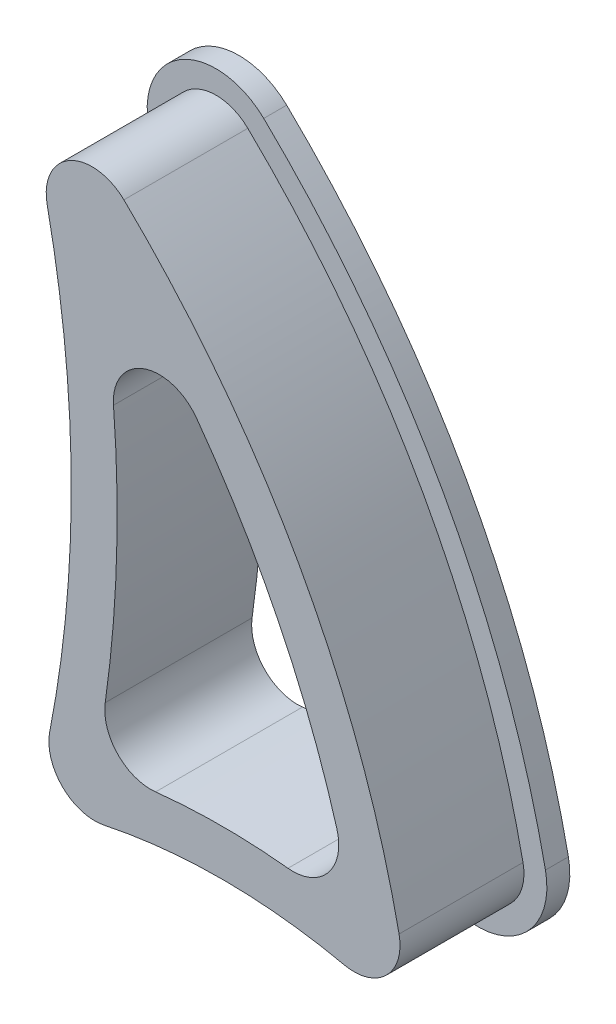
from build123d import *

# Parameters (mm, degrees)
EXTRUDE_1_DEPTH = 6.4
EXTRUDE_2_DEPTH = 1
FILLET_1_R      = 2
FILLET_2_R      = 3


with BuildPart() as part:
    # Sketch 1 → Extrude 1 (new body)
    with BuildSketch(Plane.XY):
        with BuildLine():
            ThreePointArc((-8.756657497, 29), (3.046339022, 16.342325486), (8.743342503, 0))
            ThreePointArc((8.743342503, 0), (0.493342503, 1.4004767), (-7.756657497, 0))
            ThreePointArc((-7.756657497, 0), (-6.1066553, 14.574138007), (-8.756657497, 29))
        make_face()
        with BuildLine():
            ThreePointArc((-5.052711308, 2.824732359), (0.601043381, 3.400261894), (6.250026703, 2.779646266))
            ThreePointArc((6.250026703, 2.779646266), (2.101144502, 13.980744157), (-5.170124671, 23.457371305))
            ThreePointArc((-5.170124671, 23.457371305), (-4.077797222, 13.146933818), (-5.052711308, 2.824732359))
        make_face(mode=Mode.SUBTRACT)
    extrude(amount=EXTRUDE_1_DEPTH)

    # Sketch 1_3 → Extrude 2 (add)
    with BuildSketch(Plane.XY):
        with BuildLine():
            ThreePointArc((-9.281176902, -1.680153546), (-7.125821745, 15.038837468), (-10.76407517, 31.498889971))
            ThreePointArc((-10.76407517, 31.498889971), (3.531164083, 17.463074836), (9.915438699, -1.526369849))
            ThreePointArc((9.915438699, -1.526369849), (0.30108516, 0.399706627), (-9.281176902, -1.680153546))
        make_face()
        with BuildLine():
            ThreePointArc((-7.756657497, 0), (-6.1066553, 14.574138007), (-8.756657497, 29))
            ThreePointArc((-8.756657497, 29), (3.046339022, 16.342325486), (8.743342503, 0))
            ThreePointArc((8.743342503, 0), (0.493342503, 1.4004767), (-7.756657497, 0))
        make_face(mode=Mode.SUBTRACT)
    extrude(amount=EXTRUDE_2_DEPTH)

    # Fillet 1
    fillet_1_edges = [part.edges().sort_by_distance(p)[0] for p in [
        (8.743342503, 0, 3.7),
        (-7.756657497, 0, 3.7),
        (-8.756657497, 29, 3.7),
        (6.250026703, 2.779646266, 3.2),
        (-5.170124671, 23.457371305, 3.2),
        (-5.052711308, 2.824732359, 3.2),
    ]]
    fillet(fillet_1_edges, radius=FILLET_1_R)

    # Fillet 2
    fillet_2_edges = [part.edges().sort_by_distance(p)[0] for p in [
        (-10.76407517, 31.498889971, 0.5),
        (-9.281176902, -1.680153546, 0.5),
        (9.915438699, -1.526369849, 0.5),
    ]]
    fillet(fillet_2_edges, radius=FILLET_2_R)


solid = part.part
